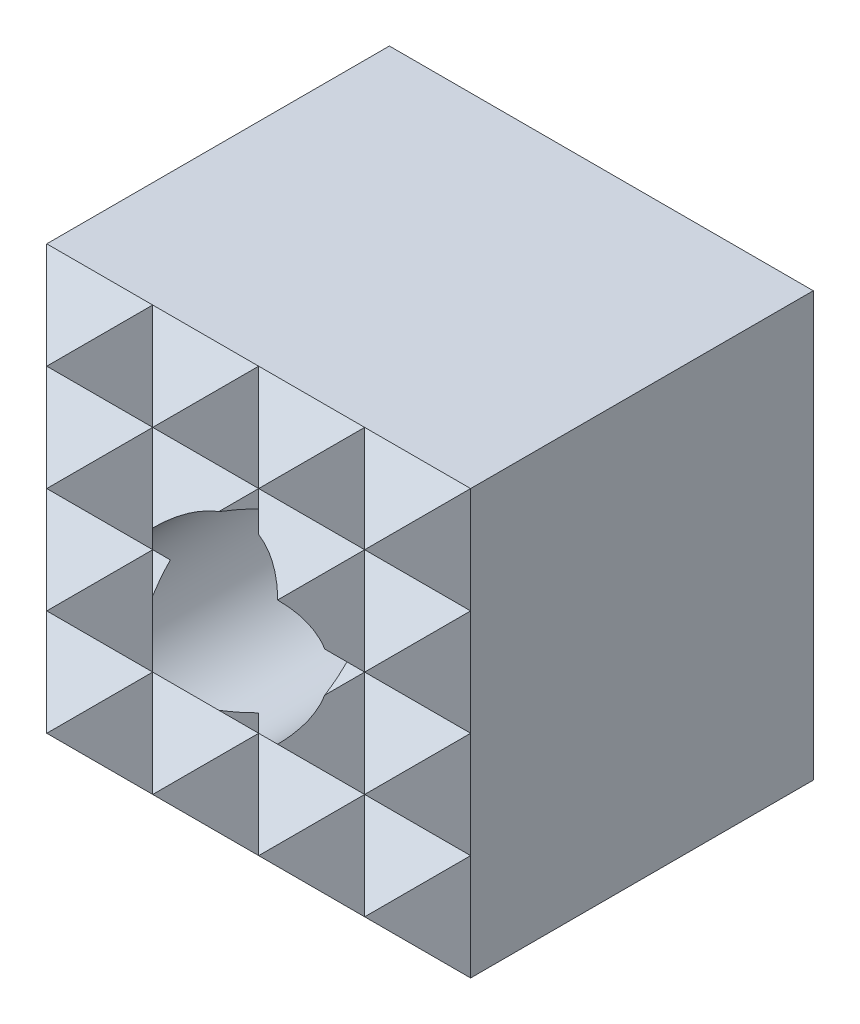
ISO-10303-21;
HEADER;
FILE_DESCRIPTION(('STEP AP214'),'2;1');
FILE_NAME('part.step','',(''),(''),'','','');
FILE_SCHEMA(('AUTOMOTIVE_DESIGN { 1 0 10303 214 1 1 1 1 }'));
ENDSEC;
DATA;
#1=APPLICATION_CONTEXT('core data for automotive mechanical design processes');
#2=APPLICATION_PROTOCOL_DEFINITION('international standard','automotive_design',2000,#1);
#3=PRODUCT_CONTEXT('',#1,'mechanical');
#4=PRODUCT('Part','Part','',(#3));
#5=PRODUCT_RELATED_PRODUCT_CATEGORY('part','',(#4));
#6=PRODUCT_DEFINITION_FORMATION('','',#4);
#7=PRODUCT_DEFINITION_CONTEXT('part definition',#1,'design');
#8=PRODUCT_DEFINITION('design','',#6,#7);
#9=PRODUCT_DEFINITION_SHAPE('','',#8);
#10=(LENGTH_UNIT() NAMED_UNIT(*) SI_UNIT(.MILLI.,.METRE.));
#11=(NAMED_UNIT(*) PLANE_ANGLE_UNIT() SI_UNIT($,.RADIAN.));
#12=(NAMED_UNIT(*) SI_UNIT($,.STERADIAN.) SOLID_ANGLE_UNIT());
#13=UNCERTAINTY_MEASURE_WITH_UNIT(LENGTH_MEASURE(1.E-05),#10,'distance_accuracy_value','');
#14=(GEOMETRIC_REPRESENTATION_CONTEXT(3) GLOBAL_UNCERTAINTY_ASSIGNED_CONTEXT((#13)) GLOBAL_UNIT_ASSIGNED_CONTEXT((#10,
#11,#12)) REPRESENTATION_CONTEXT('',''));
#15=CARTESIAN_POINT('',(0.,0.,0.));
#16=DIRECTION('',(0.,0.,1.));
#17=DIRECTION('',(1.,0.,0.));
#18=AXIS2_PLACEMENT_3D('',#15,#16,#17);
#19=CARTESIAN_POINT('',(-1.49999999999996,-10.,12.));
#20=DIRECTION('',(-0.707106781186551,0.,-0.707106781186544));
#21=DIRECTION('',(-0.707106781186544,0.,0.707106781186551));
#22=AXIS2_PLACEMENT_3D('',#19,#20,#21);
#23=PLANE('',#22);
#24=DIRECTION('',(0.,1.,0.));
#25=VECTOR('',#24,1.);
#26=CARTESIAN_POINT('',(0.,-10.,10.5));
#27=LINE('',#26,#25);
#28=CARTESIAN_POINT('',(0.,2.5,10.5));
#29=VERTEX_POINT('',#28);
#30=CARTESIAN_POINT('',(0.,3.,10.5));
#31=VERTEX_POINT('',#30);
#32=EDGE_CURVE('E484',#29,#31,#27,.T.);
#33=ORIENTED_EDGE('',*,*,#32,.T.);
#34=DIRECTION('',(-0.577350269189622,-0.577350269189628,0.577350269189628));
#35=VECTOR('',#34,1.);
#36=CARTESIAN_POINT('',(-5.33333333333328,-2.33333333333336,15.8333333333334));
#37=LINE('',#36,#35);
#38=CARTESIAN_POINT('',(-0.564585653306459,2.4354143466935,11.0645856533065));
#39=VERTEX_POINT('',#38);
#40=EDGE_CURVE('E468',#31,#39,#37,.T.);
#41=ORIENTED_EDGE('',*,*,#40,.T.);
#42=CARTESIAN_POINT('',(0.,0.,10.5));
#43=DIRECTION('',(-0.707106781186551,0.,-0.707106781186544));
#44=DIRECTION('',(-0.707106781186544,0.,0.707106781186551));
#45=AXIS2_PLACEMENT_3D('',#42,#43,#44);
#46=ELLIPSE('',#45,3.53553390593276,2.5);
#47=EDGE_CURVE('E331',#39,#29,#46,.T.);
#48=ORIENTED_EDGE('',*,*,#47,.T.);
#49=EDGE_LOOP('',(#33,#41,#48));
#50=FACE_BOUND('',#49,.T.);
#51=ADVANCED_FACE('F15',(#50),#23,.F.);
#52=CARTESIAN_POINT('',(0.,-10.,10.5));
#53=DIRECTION('',(0.707106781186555,0.,-0.707106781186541));
#54=DIRECTION('',(-0.707106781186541,0.,-0.707106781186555));
#55=AXIS2_PLACEMENT_3D('',#52,#53,#54);
#56=PLANE('',#55);
#57=CARTESIAN_POINT('',(0.,-3.,10.5));
#58=VERTEX_POINT('',#57);
#59=CARTESIAN_POINT('',(0.,-2.5,10.5));
#60=VERTEX_POINT('',#59);
#61=EDGE_CURVE('E486',#58,#60,#27,.T.);
#62=ORIENTED_EDGE('',*,*,#61,.F.);
#63=DIRECTION('',(0.577350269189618,0.577350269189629,0.57735026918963));
#64=VECTOR('',#63,1.);
#65=CARTESIAN_POINT('',(-2.33333333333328,-5.33333333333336,8.16666666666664));
#66=LINE('',#65,#64);
#67=CARTESIAN_POINT('',(0.564585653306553,-2.43541434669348,11.0645856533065));
#68=VERTEX_POINT('',#67);
#69=EDGE_CURVE('E419',#58,#68,#66,.T.);
#70=ORIENTED_EDGE('',*,*,#69,.T.);
#71=CARTESIAN_POINT('',(0.,0.,10.5));
#72=DIRECTION('',(0.707106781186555,0.,-0.707106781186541));
#73=DIRECTION('',(0.707106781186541,0.,0.707106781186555));
#74=AXIS2_PLACEMENT_3D('',#71,#72,#73);
#75=ELLIPSE('',#74,3.53553390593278,2.5);
#76=EDGE_CURVE('E327',#68,#60,#75,.T.);
#77=ORIENTED_EDGE('',*,*,#76,.T.);
#78=EDGE_LOOP('',(#62,#70,#77));
#79=FACE_BOUND('',#78,.T.);
#80=ADVANCED_FACE('F561',(#79),#56,.F.);
#81=CARTESIAN_POINT('',(-2.99999999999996,-10.,10.5));
#82=DIRECTION('',(0.707106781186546,0.,-0.707106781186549));
#83=DIRECTION('',(-0.707106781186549,0.,-0.707106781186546));
#84=AXIS2_PLACEMENT_3D('',#81,#82,#83);
#85=PLANE('',#84);
#86=DIRECTION('',(0.,1.,0.));
#87=VECTOR('',#86,1.);
#88=CARTESIAN_POINT('',(-2.99999999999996,-10.,10.5));
#89=LINE('',#88,#87);
#90=CARTESIAN_POINT('',(-2.99999999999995,0.,10.5));
#91=VERTEX_POINT('',#90);
#92=CARTESIAN_POINT('',(-2.99999999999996,3.,10.5));
#93=VERTEX_POINT('',#92);
#94=EDGE_CURVE('E688',#91,#93,#89,.T.);
#95=ORIENTED_EDGE('',*,*,#94,.F.);
#96=DIRECTION('',(0.577350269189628,0.577350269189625,0.577350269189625));
#97=VECTOR('',#96,1.);
#98=CARTESIAN_POINT('',(-6.3333333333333,-3.33333333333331,7.16666666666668));
#99=LINE('',#98,#97);
#100=CARTESIAN_POINT('',(-2.43541434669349,0.564585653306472,11.0645856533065));
#101=VERTEX_POINT('',#100);
#102=EDGE_CURVE('E450',#91,#101,#99,.T.);
#103=ORIENTED_EDGE('',*,*,#102,.T.);
#104=CARTESIAN_POINT('',(0.,0.,13.5));
#105=DIRECTION('',(0.707106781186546,0.,-0.707106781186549));
#106=DIRECTION('',(0.707106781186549,0.,0.707106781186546));
#107=AXIS2_PLACEMENT_3D('',#104,#105,#106);
#108=ELLIPSE('',#107,3.53553390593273,2.5);
#109=CARTESIAN_POINT('',(-1.76776695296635,1.76776695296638,11.7322330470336));
#110=VERTEX_POINT('',#109);
#111=EDGE_CURVE('E332',#101,#110,#108,.T.);
#112=ORIENTED_EDGE('',*,*,#111,.T.);
#113=DIRECTION('',(-0.577350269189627,0.577350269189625,-0.577350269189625));
#114=VECTOR('',#113,1.);
#115=CARTESIAN_POINT('',(1.33333333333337,-1.33333333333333,14.8333333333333));
#116=LINE('',#115,#114);
#117=EDGE_CURVE('E248',#110,#93,#116,.T.);
#118=ORIENTED_EDGE('',*,*,#117,.T.);
#119=EDGE_LOOP('',(#95,#103,#112,#118));
#120=FACE_BOUND('',#119,.T.);
#121=ADVANCED_FACE('F609',(#120),#85,.F.);
#122=CARTESIAN_POINT('',(-1.76776695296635,-1.76776695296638,11.7322330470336));
#123=VERTEX_POINT('',#122);
#124=CARTESIAN_POINT('',(-2.43541434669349,-0.564585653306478,11.0645856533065));
#125=VERTEX_POINT('',#124);
#126=EDGE_CURVE('E335',#123,#125,#108,.T.);
#127=ORIENTED_EDGE('',*,*,#126,.T.);
#128=DIRECTION('',(-0.577350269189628,0.577350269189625,-0.577350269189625));
#129=VECTOR('',#128,1.);
#130=CARTESIAN_POINT('',(0.333333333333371,-3.33333333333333,13.8333333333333));
#131=LINE('',#130,#129);
#132=EDGE_CURVE('E434',#125,#91,#131,.T.);
#133=ORIENTED_EDGE('',*,*,#132,.T.);
#134=CARTESIAN_POINT('',(-2.99999999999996,-3.,10.5));
#135=VERTEX_POINT('',#134);
#136=EDGE_CURVE('E271',#135,#91,#89,.T.);
#137=ORIENTED_EDGE('',*,*,#136,.F.);
#138=DIRECTION('',(0.577350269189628,0.577350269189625,0.577350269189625));
#139=VECTOR('',#138,1.);
#140=CARTESIAN_POINT('',(-5.3333333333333,-5.33333333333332,8.16666666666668));
#141=LINE('',#140,#139);
#142=EDGE_CURVE('E410',#135,#123,#141,.T.);
#143=ORIENTED_EDGE('',*,*,#142,.T.);
#144=EDGE_LOOP('',(#127,#133,#137,#143));
#145=FACE_BOUND('',#144,.T.);
#146=ADVANCED_FACE('F614',(#145),#85,.F.);
#147=CARTESIAN_POINT('',(-0.564585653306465,-2.43541434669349,11.0645856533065));
#148=VERTEX_POINT('',#147);
#149=EDGE_CURVE('E328',#60,#148,#46,.T.);
#150=ORIENTED_EDGE('',*,*,#149,.T.);
#151=DIRECTION('',(0.577350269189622,-0.577350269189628,-0.577350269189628));
#152=VECTOR('',#151,1.);
#153=CARTESIAN_POINT('',(1.33333333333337,-4.33333333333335,9.16666666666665));
#154=LINE('',#153,#152);
#155=EDGE_CURVE('E415',#148,#58,#154,.T.);
#156=ORIENTED_EDGE('',*,*,#155,.T.);
#157=ORIENTED_EDGE('',*,*,#61,.T.);
#158=EDGE_LOOP('',(#150,#156,#157));
#159=FACE_BOUND('',#158,.T.);
#160=ADVANCED_FACE('F564',(#159),#23,.F.);
#161=CARTESIAN_POINT('',(0.564585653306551,2.43541434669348,11.0645856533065));
#162=VERTEX_POINT('',#161);
#163=EDGE_CURVE('E324',#29,#162,#75,.T.);
#164=ORIENTED_EDGE('',*,*,#163,.T.);
#165=DIRECTION('',(-0.577350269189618,0.57735026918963,-0.57735026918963));
#166=VECTOR('',#165,1.);
#167=CARTESIAN_POINT('',(4.33333333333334,-1.33333333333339,14.8333333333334));
#168=LINE('',#167,#166);
#169=EDGE_CURVE('E472',#162,#31,#168,.T.);
#170=ORIENTED_EDGE('',*,*,#169,.T.);
#171=ORIENTED_EDGE('',*,*,#32,.F.);
#172=EDGE_LOOP('',(#164,#170,#171));
#173=FACE_BOUND('',#172,.T.);
#174=ADVANCED_FACE('F610',(#173),#56,.F.);
#175=CARTESIAN_POINT('',(1.5,-10.,12.));
#176=DIRECTION('',(-0.70710678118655,0.,-0.707106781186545));
#177=DIRECTION('',(-0.707106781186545,0.,0.70710678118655));
#178=AXIS2_PLACEMENT_3D('',#175,#176,#177);
#179=PLANE('',#178);
#180=CARTESIAN_POINT('',(0.,0.,13.5));
#181=DIRECTION('',(-0.70710678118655,0.,-0.707106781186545));
#182=DIRECTION('',(-0.707106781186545,0.,0.70710678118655));
#183=AXIS2_PLACEMENT_3D('',#180,#181,#182);
#184=ELLIPSE('',#183,3.53553390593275,2.5);
#185=CARTESIAN_POINT('',(1.76776695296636,1.76776695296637,11.7322330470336));
#186=VERTEX_POINT('',#185);
#187=CARTESIAN_POINT('',(2.43541434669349,0.564585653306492,11.0645856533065));
#188=VERTEX_POINT('',#187);
#189=EDGE_CURVE('E323',#186,#188,#184,.T.);
#190=ORIENTED_EDGE('',*,*,#189,.T.);
#191=DIRECTION('',(0.577350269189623,-0.577350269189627,-0.577350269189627));
#192=VECTOR('',#191,1.);
#193=CARTESIAN_POINT('',(5.33333333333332,-2.33333333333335,8.16666666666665));
#194=LINE('',#193,#192);
#195=CARTESIAN_POINT('',(3.,0.,10.5));
#196=VERTEX_POINT('',#195);
#197=EDGE_CURVE('E461',#188,#196,#194,.T.);
#198=ORIENTED_EDGE('',*,*,#197,.T.);
#199=DIRECTION('',(0.,1.,0.));
#200=VECTOR('',#199,1.);
#201=CARTESIAN_POINT('',(3.,-10.,10.5));
#202=LINE('',#201,#200);
#203=CARTESIAN_POINT('',(3.,3.,10.5));
#204=VERTEX_POINT('',#203);
#205=EDGE_CURVE('E496',#196,#204,#202,.T.);
#206=ORIENTED_EDGE('',*,*,#205,.T.);
#207=DIRECTION('',(-0.577350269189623,-0.577350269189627,0.577350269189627));
#208=VECTOR('',#207,1.);
#209=CARTESIAN_POINT('',(-2.33333333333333,-2.33333333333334,15.8333333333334));
#210=LINE('',#209,#208);
#211=EDGE_CURVE('E475',#204,#186,#210,.T.);
#212=ORIENTED_EDGE('',*,*,#211,.T.);
#213=EDGE_LOOP('',(#190,#198,#206,#212));
#214=FACE_BOUND('',#213,.T.);
#215=ADVANCED_FACE('F601',(#214),#179,.F.);
#216=CARTESIAN_POINT('',(3.,-3.,10.5));
#217=VERTEX_POINT('',#216);
#218=EDGE_CURVE('E490',#217,#196,#202,.T.);
#219=ORIENTED_EDGE('',*,*,#218,.T.);
#220=DIRECTION('',(-0.577350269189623,-0.577350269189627,0.577350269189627));
#221=VECTOR('',#220,1.);
#222=CARTESIAN_POINT('',(-1.33333333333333,-4.33333333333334,14.8333333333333));
#223=LINE('',#222,#221);
#224=CARTESIAN_POINT('',(2.43541434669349,-0.564585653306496,11.0645856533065));
#225=VERTEX_POINT('',#224);
#226=EDGE_CURVE('E446',#196,#225,#223,.T.);
#227=ORIENTED_EDGE('',*,*,#226,.T.);
#228=CARTESIAN_POINT('',(1.76776695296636,-1.76776695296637,11.7322330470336));
#229=VERTEX_POINT('',#228);
#230=EDGE_CURVE('E309',#225,#229,#184,.T.);
#231=ORIENTED_EDGE('',*,*,#230,.T.);
#232=DIRECTION('',(0.577350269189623,-0.577350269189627,-0.577350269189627));
#233=VECTOR('',#232,1.);
#234=CARTESIAN_POINT('',(4.33333333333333,-4.33333333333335,9.16666666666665));
#235=LINE('',#234,#233);
#236=EDGE_CURVE('E422',#229,#217,#235,.T.);
#237=ORIENTED_EDGE('',*,*,#236,.T.);
#238=EDGE_LOOP('',(#219,#227,#231,#237));
#239=FACE_BOUND('',#238,.T.);
#240=ADVANCED_FACE('F540',(#239),#179,.F.);
#241=CARTESIAN_POINT('',(3.,-10.,10.5));
#242=DIRECTION('',(0.707106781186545,0.,-0.70710678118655));
#243=DIRECTION('',(-0.70710678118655,0.,-0.707106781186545));
#244=AXIS2_PLACEMENT_3D('',#241,#242,#243);
#245=PLANE('',#244);
#246=ORIENTED_EDGE('',*,*,#218,.F.);
#247=DIRECTION('',(0.577350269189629,0.577350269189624,0.577350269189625));
#248=VECTOR('',#247,1.);
#249=CARTESIAN_POINT('',(0.666666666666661,-5.33333333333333,8.16666666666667));
#250=LINE('',#249,#248);
#251=CARTESIAN_POINT('',(4.5,-1.5,12.));
#252=VERTEX_POINT('',#251);
#253=EDGE_CURVE('E425',#217,#252,#250,.T.);
#254=ORIENTED_EDGE('',*,*,#253,.T.);
#255=DIRECTION('',(-0.577350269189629,0.577350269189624,-0.577350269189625));
#256=VECTOR('',#255,1.);
#257=CARTESIAN_POINT('',(6.33333333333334,-3.33333333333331,13.8333333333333));
#258=LINE('',#257,#256);
#259=EDGE_CURVE('E443',#252,#196,#258,.T.);
#260=ORIENTED_EDGE('',*,*,#259,.T.);
#261=EDGE_LOOP('',(#246,#254,#260));
#262=FACE_BOUND('',#261,.T.);
#263=ADVANCED_FACE('F538',(#262),#245,.F.);
#264=ORIENTED_EDGE('',*,*,#205,.F.);
#265=DIRECTION('',(0.577350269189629,0.577350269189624,0.577350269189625));
#266=VECTOR('',#265,1.);
#267=CARTESIAN_POINT('',(-0.333333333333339,-3.33333333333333,7.16666666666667));
#268=LINE('',#267,#266);
#269=CARTESIAN_POINT('',(4.5,1.5,12.));
#270=VERTEX_POINT('',#269);
#271=EDGE_CURVE('E458',#196,#270,#268,.T.);
#272=ORIENTED_EDGE('',*,*,#271,.T.);
#273=DIRECTION('',(-0.577350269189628,0.577350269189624,-0.577350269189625));
#274=VECTOR('',#273,1.);
#275=CARTESIAN_POINT('',(7.33333333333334,-1.3333333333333,14.8333333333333));
#276=LINE('',#275,#274);
#277=EDGE_CURVE('E478',#270,#204,#276,.T.);
#278=ORIENTED_EDGE('',*,*,#277,.T.);
#279=EDGE_LOOP('',(#264,#272,#278));
#280=FACE_BOUND('',#279,.T.);
#281=ADVANCED_FACE('F805',(#280),#245,.F.);
#282=CARTESIAN_POINT('',(4.5,-10.,12.));
#283=DIRECTION('',(-0.70710678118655,0.,-0.707106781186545));
#284=DIRECTION('',(-0.707106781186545,0.,0.70710678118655));
#285=AXIS2_PLACEMENT_3D('',#282,#283,#284);
#286=PLANE('',#285);
#287=DIRECTION('',(-0.577350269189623,-0.577350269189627,0.577350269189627));
#288=VECTOR('',#287,1.);
#289=CARTESIAN_POINT('',(2.66666666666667,-6.33333333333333,13.8333333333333));
#290=LINE('',#289,#288);
#291=CARTESIAN_POINT('',(6.,-3.,10.5));
#292=VERTEX_POINT('',#291);
#293=CARTESIAN_POINT('',(4.5,-4.5,12.));
#294=VERTEX_POINT('',#293);
#295=EDGE_CURVE('E405',#292,#294,#290,.T.);
#296=ORIENTED_EDGE('',*,*,#295,.T.);
#297=DIRECTION('',(0.577350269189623,-0.577350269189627,-0.577350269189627));
#298=VECTOR('',#297,1.);
#299=CARTESIAN_POINT('',(6.33333333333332,-6.33333333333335,10.1666666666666));
#300=LINE('',#299,#298);
#301=CARTESIAN_POINT('',(6.,-6.,10.5));
#302=VERTEX_POINT('',#301);
#303=EDGE_CURVE('E387',#294,#302,#300,.T.);
#304=ORIENTED_EDGE('',*,*,#303,.T.);
#305=DIRECTION('',(0.,1.,0.));
#306=VECTOR('',#305,1.);
#307=CARTESIAN_POINT('',(6.,-10.,10.5));
#308=LINE('',#307,#306);
#309=EDGE_CURVE('E268',#302,#292,#308,.T.);
#310=ORIENTED_EDGE('',*,*,#309,.T.);
#311=EDGE_LOOP('',(#296,#304,#310));
#312=FACE_BOUND('',#311,.T.);
#313=ADVANCED_FACE('F702',(#312),#286,.F.);
#314=DIRECTION('',(-0.577350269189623,-0.577350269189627,0.577350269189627));
#315=VECTOR('',#314,1.);
#316=CARTESIAN_POINT('',(1.66666666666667,-4.33333333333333,14.8333333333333));
#317=LINE('',#316,#315);
#318=CARTESIAN_POINT('',(6.,0.,10.5));
#319=VERTEX_POINT('',#318);
#320=EDGE_CURVE('E439',#319,#252,#317,.T.);
#321=ORIENTED_EDGE('',*,*,#320,.T.);
#322=DIRECTION('',(0.577350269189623,-0.577350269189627,-0.577350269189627));
#323=VECTOR('',#322,1.);
#324=CARTESIAN_POINT('',(7.33333333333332,-4.33333333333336,9.16666666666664));
#325=LINE('',#324,#323);
#326=EDGE_CURVE('E428',#252,#292,#325,.T.);
#327=ORIENTED_EDGE('',*,*,#326,.T.);
#328=EDGE_CURVE('E504',#292,#319,#308,.T.);
#329=ORIENTED_EDGE('',*,*,#328,.T.);
#330=EDGE_LOOP('',(#321,#327,#329));
#331=FACE_BOUND('',#330,.T.);
#332=ADVANCED_FACE('F522',(#331),#286,.F.);
#333=DIRECTION('',(-0.577350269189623,-0.577350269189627,0.577350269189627));
#334=VECTOR('',#333,1.);
#335=CARTESIAN_POINT('',(0.666666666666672,-2.33333333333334,15.8333333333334));
#336=LINE('',#335,#334);
#337=CARTESIAN_POINT('',(6.,3.,10.5));
#338=VERTEX_POINT('',#337);
#339=EDGE_CURVE('E481',#338,#270,#336,.T.);
#340=ORIENTED_EDGE('',*,*,#339,.T.);
#341=DIRECTION('',(0.577350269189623,-0.577350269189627,-0.577350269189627));
#342=VECTOR('',#341,1.);
#343=CARTESIAN_POINT('',(8.33333333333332,-2.33333333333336,8.16666666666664));
#344=LINE('',#343,#342);
#345=EDGE_CURVE('E455',#270,#319,#344,.T.);
#346=ORIENTED_EDGE('',*,*,#345,.T.);
#347=EDGE_CURVE('E508',#319,#338,#308,.T.);
#348=ORIENTED_EDGE('',*,*,#347,.T.);
#349=EDGE_LOOP('',(#340,#346,#348));
#350=FACE_BOUND('',#349,.T.);
#351=ADVANCED_FACE('F517',(#350),#286,.F.);
#352=CARTESIAN_POINT('',(-6.,-10.,10.5));
#353=DIRECTION('',(0.707106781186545,0.,-0.70710678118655));
#354=DIRECTION('',(-0.70710678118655,0.,-0.707106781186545));
#355=AXIS2_PLACEMENT_3D('',#352,#353,#354);
#356=PLANE('',#355);
#357=DIRECTION('',(0.,1.,0.));
#358=VECTOR('',#357,1.);
#359=CARTESIAN_POINT('',(-6.,-10.,10.5));
#360=LINE('',#359,#358);
#361=CARTESIAN_POINT('',(-6.,-6.,10.5));
#362=VERTEX_POINT('',#361);
#363=CARTESIAN_POINT('',(-6.,-3.,10.5));
#364=VERTEX_POINT('',#363);
#365=EDGE_CURVE('E259',#362,#364,#360,.T.);
#366=ORIENTED_EDGE('',*,*,#365,.F.);
#367=DIRECTION('',(0.577350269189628,0.577350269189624,0.577350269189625));
#368=VECTOR('',#367,1.);
#369=CARTESIAN_POINT('',(-7.33333333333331,-7.33333333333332,9.16666666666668));
#370=LINE('',#369,#368);
#371=CARTESIAN_POINT('',(-4.49999999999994,-4.5,12.));
#372=VERTEX_POINT('',#371);
#373=EDGE_CURVE('E362',#362,#372,#370,.T.);
#374=ORIENTED_EDGE('',*,*,#373,.T.);
#375=DIRECTION('',(-0.577350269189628,0.577350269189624,-0.577350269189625));
#376=VECTOR('',#375,1.);
#377=CARTESIAN_POINT('',(-3.66666666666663,-5.33333333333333,12.8333333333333));
#378=LINE('',#377,#376);
#379=EDGE_CURVE('E364',#372,#364,#378,.T.);
#380=ORIENTED_EDGE('',*,*,#379,.T.);
#381=EDGE_LOOP('',(#366,#374,#380));
#382=FACE_BOUND('',#381,.T.);
#383=ADVANCED_FACE('F363',(#382),#356,.F.);
#384=CARTESIAN_POINT('',(-6.,0.,10.5));
#385=VERTEX_POINT('',#384);
#386=EDGE_CURVE('E264',#364,#385,#360,.T.);
#387=ORIENTED_EDGE('',*,*,#386,.F.);
#388=DIRECTION('',(0.577350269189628,0.577350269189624,0.577350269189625));
#389=VECTOR('',#388,1.);
#390=CARTESIAN_POINT('',(-8.33333333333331,-5.33333333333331,8.16666666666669));
#391=LINE('',#390,#389);
#392=CARTESIAN_POINT('',(-4.49999999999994,-1.5,12.));
#393=VERTEX_POINT('',#392);
#394=EDGE_CURVE('E407',#364,#393,#391,.T.);
#395=ORIENTED_EDGE('',*,*,#394,.T.);
#396=DIRECTION('',(-0.577350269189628,0.577350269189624,-0.577350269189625));
#397=VECTOR('',#396,1.);
#398=CARTESIAN_POINT('',(-2.66666666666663,-3.33333333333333,13.8333333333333));
#399=LINE('',#398,#397);
#400=EDGE_CURVE('E431',#393,#385,#399,.T.);
#401=ORIENTED_EDGE('',*,*,#400,.T.);
#402=EDGE_LOOP('',(#387,#395,#401));
#403=FACE_BOUND('',#402,.T.);
#404=ADVANCED_FACE('F824',(#403),#356,.F.);
#405=CARTESIAN_POINT('',(-6.,3.,10.5));
#406=VERTEX_POINT('',#405);
#407=EDGE_CURVE('E245',#385,#406,#360,.T.);
#408=ORIENTED_EDGE('',*,*,#407,.F.);
#409=DIRECTION('',(0.577350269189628,0.577350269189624,0.577350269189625));
#410=VECTOR('',#409,1.);
#411=CARTESIAN_POINT('',(-9.33333333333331,-3.33333333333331,7.16666666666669));
#412=LINE('',#411,#410);
#413=CARTESIAN_POINT('',(-4.49999999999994,1.5,12.));
#414=VERTEX_POINT('',#413);
#415=EDGE_CURVE('E247',#385,#414,#412,.T.);
#416=ORIENTED_EDGE('',*,*,#415,.T.);
#417=DIRECTION('',(-0.577350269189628,0.577350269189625,-0.577350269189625));
#418=VECTOR('',#417,1.);
#419=CARTESIAN_POINT('',(-1.66666666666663,-1.33333333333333,14.8333333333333));
#420=LINE('',#419,#418);
#421=EDGE_CURVE('E232',#414,#406,#420,.T.);
#422=ORIENTED_EDGE('',*,*,#421,.T.);
#423=EDGE_LOOP('',(#408,#416,#422));
#424=FACE_BOUND('',#423,.T.);
#425=ADVANCED_FACE('F243',(#424),#356,.F.);
#426=CARTESIAN_POINT('',(-4.49999999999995,-10.,12.));
#427=DIRECTION('',(-0.70710678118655,0.,-0.707106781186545));
#428=DIRECTION('',(-0.707106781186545,0.,0.70710678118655));
#429=AXIS2_PLACEMENT_3D('',#426,#427,#428);
#430=PLANE('',#429);
#431=DIRECTION('',(-0.577350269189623,-0.577350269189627,0.577350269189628));
#432=VECTOR('',#431,1.);
#433=CARTESIAN_POINT('',(-7.33333333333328,-4.33333333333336,14.8333333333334));
#434=LINE('',#433,#432);
#435=EDGE_CURVE('E343',#91,#393,#434,.T.);
#436=ORIENTED_EDGE('',*,*,#435,.T.);
#437=DIRECTION('',(0.577350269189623,-0.577350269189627,-0.577350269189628));
#438=VECTOR('',#437,1.);
#439=CARTESIAN_POINT('',(-1.66666666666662,-4.33333333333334,9.16666666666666));
#440=LINE('',#439,#438);
#441=EDGE_CURVE('E346',#393,#135,#440,.T.);
#442=ORIENTED_EDGE('',*,*,#441,.T.);
#443=ORIENTED_EDGE('',*,*,#136,.T.);
#444=EDGE_LOOP('',(#436,#442,#443));
#445=FACE_BOUND('',#444,.T.);
#446=ADVANCED_FACE('F776',(#445),#430,.F.);
#447=DIRECTION('',(-0.577350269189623,-0.577350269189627,0.577350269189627));
#448=VECTOR('',#447,1.);
#449=CARTESIAN_POINT('',(-8.33333333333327,-2.33333333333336,15.8333333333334));
#450=LINE('',#449,#448);
#451=EDGE_CURVE('E235',#93,#414,#450,.T.);
#452=ORIENTED_EDGE('',*,*,#451,.T.);
#453=DIRECTION('',(0.577350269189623,-0.577350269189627,-0.577350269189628));
#454=VECTOR('',#453,1.);
#455=CARTESIAN_POINT('',(-0.666666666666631,-2.33333333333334,8.16666666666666));
#456=LINE('',#455,#454);
#457=EDGE_CURVE('E340',#414,#91,#456,.T.);
#458=ORIENTED_EDGE('',*,*,#457,.T.);
#459=ORIENTED_EDGE('',*,*,#94,.T.);
#460=EDGE_LOOP('',(#452,#458,#459));
#461=FACE_BOUND('',#460,.T.);
#462=ADVANCED_FACE('F1143',(#461),#430,.F.);
#463=CARTESIAN_POINT('',(-6.,-6.,0.));
#464=DIRECTION('',(0.,0.,-1.));
#465=DIRECTION('',(-1.,0.,0.));
#466=AXIS2_PLACEMENT_3D('',#463,#464,#465);
#467=PLANE('',#466);
#468=DIRECTION('',(0.,-1.,0.));
#469=VECTOR('',#468,1.);
#470=CARTESIAN_POINT('',(5.2,-6.,0.));
#471=LINE('',#470,#469);
#472=CARTESIAN_POINT('',(5.2,5.2,0.));
#473=VERTEX_POINT('',#472);
#474=CARTESIAN_POINT('',(5.2,-5.2,0.));
#475=VERTEX_POINT('',#474);
#476=EDGE_CURVE('E288',#473,#475,#471,.T.);
#477=ORIENTED_EDGE('',*,*,#476,.T.);
#478=DIRECTION('',(-1.,0.,0.));
#479=VECTOR('',#478,1.);
#480=CARTESIAN_POINT('',(-6.,-5.2,0.));
#481=LINE('',#480,#479);
#482=CARTESIAN_POINT('',(-5.2,-5.2,0.));
#483=VERTEX_POINT('',#482);
#484=EDGE_CURVE('E294',#475,#483,#481,.T.);
#485=ORIENTED_EDGE('',*,*,#484,.T.);
#486=DIRECTION('',(0.,1.,0.));
#487=VECTOR('',#486,1.);
#488=CARTESIAN_POINT('',(-5.2,6.,0.));
#489=LINE('',#488,#487);
#490=CARTESIAN_POINT('',(-5.2,5.2,0.));
#491=VERTEX_POINT('',#490);
#492=EDGE_CURVE('E292',#483,#491,#489,.T.);
#493=ORIENTED_EDGE('',*,*,#492,.T.);
#494=DIRECTION('',(1.,0.,0.));
#495=VECTOR('',#494,1.);
#496=CARTESIAN_POINT('',(-6.,5.2,0.));
#497=LINE('',#496,#495);
#498=EDGE_CURVE('E290',#491,#473,#497,.T.);
#499=ORIENTED_EDGE('',*,*,#498,.T.);
#500=EDGE_LOOP('',(#477,#485,#493,#499));
#501=FACE_BOUND('',#500,.T.);
#502=CARTESIAN_POINT('',(0.,0.,0.));
#503=DIRECTION('',(0.,0.,-1.));
#504=DIRECTION('',(-1.,0.,0.));
#505=AXIS2_PLACEMENT_3D('',#502,#503,#504);
#506=CIRCLE('',#505,2.95);
#507=CARTESIAN_POINT('',(-2.95,0.,0.));
#508=VERTEX_POINT('',#507);
#509=EDGE_CURVE('E282',#508,#508,#506,.F.);
#510=ORIENTED_EDGE('',*,*,#509,.T.);
#511=EDGE_LOOP('',(#510));
#512=FACE_BOUND('',#511,.T.);
#513=ADVANCED_FACE('F839',(#501,#512),#467,.T.);
#514=CARTESIAN_POINT('',(-6.,6.,12.));
#515=DIRECTION('',(1.,0.,0.));
#516=DIRECTION('',(0.,1.,0.));
#517=AXIS2_PLACEMENT_3D('',#514,#515,#516);
#518=PLANE('',#517);
#519=DIRECTION('',(0.,0.,-1.));
#520=VECTOR('',#519,1.);
#521=CARTESIAN_POINT('',(-6.,-6.,12.));
#522=LINE('',#521,#520);
#523=CARTESIAN_POINT('',(-6.,-6.,0.8));
#524=VERTEX_POINT('',#523);
#525=EDGE_CURVE('E280',#362,#524,#522,.T.);
#526=ORIENTED_EDGE('',*,*,#525,.F.);
#527=ORIENTED_EDGE('',*,*,#365,.T.);
#528=ORIENTED_EDGE('',*,*,#386,.T.);
#529=ORIENTED_EDGE('',*,*,#407,.T.);
#530=CARTESIAN_POINT('',(-6.,6.,10.5));
#531=VERTEX_POINT('',#530);
#532=EDGE_CURVE('E252',#406,#531,#360,.T.);
#533=ORIENTED_EDGE('',*,*,#532,.T.);
#534=DIRECTION('',(0.,0.,-1.));
#535=VECTOR('',#534,1.);
#536=CARTESIAN_POINT('',(-6.,6.,12.));
#537=LINE('',#536,#535);
#538=CARTESIAN_POINT('',(-6.,6.,0.8));
#539=VERTEX_POINT('',#538);
#540=EDGE_CURVE('E273',#531,#539,#537,.T.);
#541=ORIENTED_EDGE('',*,*,#540,.T.);
#542=DIRECTION('',(0.,-1.,0.));
#543=VECTOR('',#542,1.);
#544=CARTESIAN_POINT('',(-6.,-6.,0.8));
#545=LINE('',#544,#543);
#546=EDGE_CURVE('E300',#539,#524,#545,.T.);
#547=ORIENTED_EDGE('',*,*,#546,.T.);
#548=EDGE_LOOP('',(#526,#527,#528,#529,#533,#541,#547));
#549=FACE_BOUND('',#548,.T.);
#550=ADVANCED_FACE('F261',(#549),#518,.F.);
#551=CARTESIAN_POINT('',(6.,-6.,12.));
#552=DIRECTION('',(0.,-1.,0.));
#553=DIRECTION('',(1.,0.,0.));
#554=AXIS2_PLACEMENT_3D('',#551,#552,#553);
#555=PLANE('',#554);
#556=DIRECTION('',(1.,0.,0.));
#557=VECTOR('',#556,1.);
#558=CARTESIAN_POINT('',(-10.,-6.,10.5));
#559=LINE('',#558,#557);
#560=CARTESIAN_POINT('',(-2.99999999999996,-6.,10.5));
#561=VERTEX_POINT('',#560);
#562=EDGE_CURVE('E690',#362,#561,#559,.T.);
#563=ORIENTED_EDGE('',*,*,#562,.F.);
#564=ORIENTED_EDGE('',*,*,#525,.T.);
#565=DIRECTION('',(1.,0.,0.));
#566=VECTOR('',#565,1.);
#567=CARTESIAN_POINT('',(6.,-6.,0.8));
#568=LINE('',#567,#566);
#569=CARTESIAN_POINT('',(6.,-6.,0.8));
#570=VERTEX_POINT('',#569);
#571=EDGE_CURVE('E297',#524,#570,#568,.T.);
#572=ORIENTED_EDGE('',*,*,#571,.T.);
#573=DIRECTION('',(0.,0.,-1.));
#574=VECTOR('',#573,1.);
#575=CARTESIAN_POINT('',(6.,-6.,12.));
#576=LINE('',#575,#574);
#577=EDGE_CURVE('E278',#302,#570,#576,.T.);
#578=ORIENTED_EDGE('',*,*,#577,.F.);
#579=CARTESIAN_POINT('',(3.,-6.,10.5));
#580=VERTEX_POINT('',#579);
#581=EDGE_CURVE('E664',#580,#302,#559,.T.);
#582=ORIENTED_EDGE('',*,*,#581,.F.);
#583=CARTESIAN_POINT('',(0.,-6.,10.5));
#584=VERTEX_POINT('',#583);
#585=EDGE_CURVE('E578',#584,#580,#559,.T.);
#586=ORIENTED_EDGE('',*,*,#585,.F.);
#587=EDGE_CURVE('E693',#561,#584,#559,.T.);
#588=ORIENTED_EDGE('',*,*,#587,.F.);
#589=EDGE_LOOP('',(#563,#564,#572,#578,#582,#586,#588));
#590=FACE_BOUND('',#589,.T.);
#591=ADVANCED_FACE('F697',(#590),#555,.T.);
#592=CARTESIAN_POINT('',(6.,-6.,12.));
#593=DIRECTION('',(-1.,0.,0.));
#594=DIRECTION('',(0.,0.,1.));
#595=AXIS2_PLACEMENT_3D('',#592,#593,#594);
#596=PLANE('',#595);
#597=DIRECTION('',(0.,0.,-1.));
#598=VECTOR('',#597,1.);
#599=CARTESIAN_POINT('',(6.,6.,12.));
#600=LINE('',#599,#598);
#601=CARTESIAN_POINT('',(6.,6.,10.5));
#602=VERTEX_POINT('',#601);
#603=CARTESIAN_POINT('',(6.,6.,0.8));
#604=VERTEX_POINT('',#603);
#605=EDGE_CURVE('E275',#602,#604,#600,.T.);
#606=ORIENTED_EDGE('',*,*,#605,.F.);
#607=EDGE_CURVE('E267',#338,#602,#308,.T.);
#608=ORIENTED_EDGE('',*,*,#607,.F.);
#609=ORIENTED_EDGE('',*,*,#347,.F.);
#610=ORIENTED_EDGE('',*,*,#328,.F.);
#611=ORIENTED_EDGE('',*,*,#309,.F.);
#612=ORIENTED_EDGE('',*,*,#577,.T.);
#613=DIRECTION('',(0.,1.,0.));
#614=VECTOR('',#613,1.);
#615=CARTESIAN_POINT('',(6.,6.,0.8));
#616=LINE('',#615,#614);
#617=EDGE_CURVE('E306',#570,#604,#616,.T.);
#618=ORIENTED_EDGE('',*,*,#617,.T.);
#619=EDGE_LOOP('',(#606,#608,#609,#610,#611,#612,#618));
#620=FACE_BOUND('',#619,.T.);
#621=ADVANCED_FACE('F520',(#620),#596,.F.);
#622=CARTESIAN_POINT('',(-6.,6.,12.));
#623=DIRECTION('',(0.,1.,0.));
#624=DIRECTION('',(-1.,0.,0.));
#625=AXIS2_PLACEMENT_3D('',#622,#623,#624);
#626=PLANE('',#625);
#627=DIRECTION('',(1.,0.,0.));
#628=VECTOR('',#627,1.);
#629=CARTESIAN_POINT('',(-10.,6.,10.5));
#630=LINE('',#629,#628);
#631=CARTESIAN_POINT('',(3.,6.,10.5));
#632=VERTEX_POINT('',#631);
#633=EDGE_CURVE('E236',#632,#602,#630,.T.);
#634=ORIENTED_EDGE('',*,*,#633,.T.);
#635=ORIENTED_EDGE('',*,*,#605,.T.);
#636=DIRECTION('',(-1.,0.,0.));
#637=VECTOR('',#636,1.);
#638=CARTESIAN_POINT('',(-6.,6.,0.8));
#639=LINE('',#638,#637);
#640=EDGE_CURVE('E303',#604,#539,#639,.T.);
#641=ORIENTED_EDGE('',*,*,#640,.T.);
#642=ORIENTED_EDGE('',*,*,#540,.F.);
#643=CARTESIAN_POINT('',(-2.99999999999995,6.,10.5));
#644=VERTEX_POINT('',#643);
#645=EDGE_CURVE('E658',#531,#644,#630,.T.);
#646=ORIENTED_EDGE('',*,*,#645,.T.);
#647=CARTESIAN_POINT('',(0.,6.,10.5));
#648=VERTEX_POINT('',#647);
#649=EDGE_CURVE('E662',#644,#648,#630,.T.);
#650=ORIENTED_EDGE('',*,*,#649,.T.);
#651=EDGE_CURVE('E656',#648,#632,#630,.T.);
#652=ORIENTED_EDGE('',*,*,#651,.T.);
#653=EDGE_LOOP('',(#634,#635,#641,#642,#646,#650,#652));
#654=FACE_BOUND('',#653,.T.);
#655=ADVANCED_FACE('F660',(#654),#626,.T.);
#656=CARTESIAN_POINT('',(0.,0.,12.));
#657=DIRECTION('',(0.,0.,1.));
#658=DIRECTION('',(1.,0.,0.));
#659=AXIS2_PLACEMENT_3D('',#656,#657,#658);
#660=CYLINDRICAL_SURFACE('',#659,2.5);
#661=CARTESIAN_POINT('',(0.,0.,13.5));
#662=DIRECTION('',(0.,-0.707106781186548,-0.707106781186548));
#663=DIRECTION('',(0.,-0.707106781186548,0.707106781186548));
#664=AXIS2_PLACEMENT_3D('',#661,#662,#663);
#665=ELLIPSE('',#664,3.53553390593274,2.5);
#666=EDGE_CURVE('E466',#110,#39,#665,.T.);
#667=ORIENTED_EDGE('',*,*,#666,.F.);
#668=ORIENTED_EDGE('',*,*,#111,.F.);
#669=CARTESIAN_POINT('',(0.,0.,10.5));
#670=DIRECTION('',(0.,0.707106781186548,-0.707106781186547));
#671=DIRECTION('',(0.,0.707106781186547,0.707106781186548));
#672=AXIS2_PLACEMENT_3D('',#669,#670,#671);
#673=ELLIPSE('',#672,3.53553390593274,2.5);
#674=CARTESIAN_POINT('',(-2.5,0.,10.5));
#675=VERTEX_POINT('',#674);
#676=EDGE_CURVE('E453',#675,#101,#673,.T.);
#677=ORIENTED_EDGE('',*,*,#676,.F.);
#678=CARTESIAN_POINT('',(0.,0.,10.5));
#679=DIRECTION('',(0.,-0.707106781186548,-0.707106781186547));
#680=DIRECTION('',(0.,-0.707106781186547,0.707106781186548));
#681=AXIS2_PLACEMENT_3D('',#678,#679,#680);
#682=ELLIPSE('',#681,3.53553390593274,2.5);
#683=EDGE_CURVE('E437',#125,#675,#682,.T.);
#684=ORIENTED_EDGE('',*,*,#683,.F.);
#685=ORIENTED_EDGE('',*,*,#126,.F.);
#686=CARTESIAN_POINT('',(0.,0.,13.5));
#687=DIRECTION('',(0.,0.707106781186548,-0.707106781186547));
#688=DIRECTION('',(0.,0.707106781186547,0.707106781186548));
#689=AXIS2_PLACEMENT_3D('',#686,#687,#688);
#690=ELLIPSE('',#689,3.53553390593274,2.5);
#691=EDGE_CURVE('E413',#148,#123,#690,.T.);
#692=ORIENTED_EDGE('',*,*,#691,.F.);
#693=ORIENTED_EDGE('',*,*,#149,.F.);
#694=ORIENTED_EDGE('',*,*,#76,.F.);
#695=EDGE_CURVE('E416',#229,#68,#690,.T.);
#696=ORIENTED_EDGE('',*,*,#695,.F.);
#697=ORIENTED_EDGE('',*,*,#230,.F.);
#698=CARTESIAN_POINT('',(2.5,0.,10.5));
#699=VERTEX_POINT('',#698);
#700=EDGE_CURVE('E440',#699,#225,#682,.T.);
#701=ORIENTED_EDGE('',*,*,#700,.F.);
#702=EDGE_CURVE('E249',#188,#699,#673,.T.);
#703=ORIENTED_EDGE('',*,*,#702,.F.);
#704=ORIENTED_EDGE('',*,*,#189,.F.);
#705=EDGE_CURVE('E469',#162,#186,#665,.T.);
#706=ORIENTED_EDGE('',*,*,#705,.F.);
#707=ORIENTED_EDGE('',*,*,#163,.F.);
#708=ORIENTED_EDGE('',*,*,#47,.F.);
#709=EDGE_LOOP('',(#667,#668,#677,#684,#685,#692,#693,#694,#696,#697,#701,#703,#704,#706,#707,#708));
#710=FACE_BOUND('',#709,.T.);
#711=CARTESIAN_POINT('',(0.,0.,0.45));
#712=DIRECTION('',(0.,0.,-1.));
#713=DIRECTION('',(-1.,0.,0.));
#714=AXIS2_PLACEMENT_3D('',#711,#712,#713);
#715=CIRCLE('',#714,2.5);
#716=CARTESIAN_POINT('',(-2.5,0.,0.45));
#717=VERTEX_POINT('',#716);
#718=EDGE_CURVE('E285',#717,#717,#715,.T.);
#719=ORIENTED_EDGE('',*,*,#718,.T.);
#720=EDGE_LOOP('',(#719));
#721=FACE_BOUND('',#720,.T.);
#722=ADVANCED_FACE('F553',(#710,#721),#660,.F.);
#723=CARTESIAN_POINT('',(0.,0.,0.));
#724=DIRECTION('',(0.,0.,-1.));
#725=DIRECTION('',(-1.,0.,0.));
#726=AXIS2_PLACEMENT_3D('',#723,#724,#725);
#727=CONICAL_SURFACE('',#726,2.95,0.785398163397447);
#728=ORIENTED_EDGE('',*,*,#718,.F.);
#729=EDGE_LOOP('',(#728));
#730=FACE_BOUND('',#729,.T.);
#731=ORIENTED_EDGE('',*,*,#509,.F.);
#732=EDGE_LOOP('',(#731));
#733=FACE_BOUND('',#732,.T.);
#734=ADVANCED_FACE('F848',(#730,#733),#727,.F.);
#735=CARTESIAN_POINT('',(-6.,5.2,0.));
#736=DIRECTION('',(0.,-0.707106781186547,0.707106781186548));
#737=DIRECTION('',(0.,-0.707106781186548,-0.707106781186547));
#738=AXIS2_PLACEMENT_3D('',#735,#736,#737);
#739=PLANE('',#738);
#740=DIRECTION('',(0.577350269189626,-0.577350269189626,-0.577350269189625));
#741=VECTOR('',#740,1.);
#742=CARTESIAN_POINT('',(-5.46666666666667,5.46666666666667,0.266666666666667));
#743=LINE('',#742,#741);
#744=EDGE_CURVE('E316',#539,#491,#743,.T.);
#745=ORIENTED_EDGE('',*,*,#744,.F.);
#746=ORIENTED_EDGE('',*,*,#640,.F.);
#747=DIRECTION('',(-0.577350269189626,-0.577350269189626,-0.577350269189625));
#748=VECTOR('',#747,1.);
#749=CARTESIAN_POINT('',(2.,2.,-3.2));
#750=LINE('',#749,#748);
#751=EDGE_CURVE('E276',#473,#604,#750,.F.);
#752=ORIENTED_EDGE('',*,*,#751,.F.);
#753=ORIENTED_EDGE('',*,*,#498,.F.);
#754=EDGE_LOOP('',(#745,#746,#752,#753));
#755=FACE_BOUND('',#754,.T.);
#756=ADVANCED_FACE('F17',(#755),#739,.F.);
#757=CARTESIAN_POINT('',(6.,-6.,0.8));
#758=DIRECTION('',(0.707106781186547,0.,-0.707106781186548));
#759=DIRECTION('',(-0.707106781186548,0.,-0.707106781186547));
#760=AXIS2_PLACEMENT_3D('',#757,#758,#759);
#761=PLANE('',#760);
#762=ORIENTED_EDGE('',*,*,#751,.T.);
#763=ORIENTED_EDGE('',*,*,#617,.F.);
#764=DIRECTION('',(0.577350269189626,-0.577350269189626,0.577350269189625));
#765=VECTOR('',#764,1.);
#766=CARTESIAN_POINT('',(6.,-6.,0.8));
#767=LINE('',#766,#765);
#768=EDGE_CURVE('E312',#475,#570,#767,.T.);
#769=ORIENTED_EDGE('',*,*,#768,.F.);
#770=ORIENTED_EDGE('',*,*,#476,.F.);
#771=EDGE_LOOP('',(#762,#763,#769,#770));
#772=FACE_BOUND('',#771,.T.);
#773=ADVANCED_FACE('F844',(#772),#761,.T.);
#774=CARTESIAN_POINT('',(-6.,6.,0.8));
#775=DIRECTION('',(-0.707106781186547,0.,-0.707106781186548));
#776=DIRECTION('',(-0.707106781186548,0.,0.707106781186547));
#777=AXIS2_PLACEMENT_3D('',#774,#775,#776);
#778=PLANE('',#777);
#779=ORIENTED_EDGE('',*,*,#744,.T.);
#780=ORIENTED_EDGE('',*,*,#492,.F.);
#781=DIRECTION('',(0.577350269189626,0.577350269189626,-0.577350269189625));
#782=VECTOR('',#781,1.);
#783=CARTESIAN_POINT('',(-2.,-2.,-3.2));
#784=LINE('',#783,#782);
#785=EDGE_CURVE('E310',#524,#483,#784,.T.);
#786=ORIENTED_EDGE('',*,*,#785,.F.);
#787=ORIENTED_EDGE('',*,*,#546,.F.);
#788=EDGE_LOOP('',(#779,#780,#786,#787));
#789=FACE_BOUND('',#788,.T.);
#790=ADVANCED_FACE('F835',(#789),#778,.T.);
#791=CARTESIAN_POINT('',(-6.,-5.2,0.));
#792=DIRECTION('',(0.,0.707106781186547,0.707106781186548));
#793=DIRECTION('',(0.,-0.707106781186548,0.707106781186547));
#794=AXIS2_PLACEMENT_3D('',#791,#792,#793);
#795=PLANE('',#794);
#796=ORIENTED_EDGE('',*,*,#768,.T.);
#797=ORIENTED_EDGE('',*,*,#571,.F.);
#798=ORIENTED_EDGE('',*,*,#785,.T.);
#799=ORIENTED_EDGE('',*,*,#484,.F.);
#800=EDGE_LOOP('',(#796,#797,#798,#799));
#801=FACE_BOUND('',#800,.T.);
#802=ADVANCED_FACE('F829',(#801),#795,.F.);
#803=ORIENTED_EDGE('',*,*,#607,.T.);
#804=DIRECTION('',(-0.577350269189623,-0.577350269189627,0.577350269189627));
#805=VECTOR('',#804,1.);
#806=CARTESIAN_POINT('',(-0.333333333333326,-0.333333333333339,16.8333333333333));
#807=LINE('',#806,#805);
#808=CARTESIAN_POINT('',(4.5,4.5,12.));
#809=VERTEX_POINT('',#808);
#810=EDGE_CURVE('E369',#602,#809,#807,.T.);
#811=ORIENTED_EDGE('',*,*,#810,.T.);
#812=DIRECTION('',(0.577350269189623,-0.577350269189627,-0.577350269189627));
#813=VECTOR('',#812,1.);
#814=CARTESIAN_POINT('',(9.33333333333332,-0.333333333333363,7.16666666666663));
#815=LINE('',#814,#813);
#816=EDGE_CURVE('E676',#809,#338,#815,.T.);
#817=ORIENTED_EDGE('',*,*,#816,.T.);
#818=EDGE_LOOP('',(#803,#811,#817));
#819=FACE_BOUND('',#818,.T.);
#820=ADVANCED_FACE('F865',(#819),#286,.F.);
#821=DIRECTION('',(0.577350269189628,0.577350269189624,0.577350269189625));
#822=VECTOR('',#821,1.);
#823=CARTESIAN_POINT('',(-10.3333333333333,-1.3333333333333,6.1666666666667));
#824=LINE('',#823,#822);
#825=CARTESIAN_POINT('',(-4.49999999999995,4.5,12.));
#826=VERTEX_POINT('',#825);
#827=EDGE_CURVE('E215',#406,#826,#824,.T.);
#828=ORIENTED_EDGE('',*,*,#827,.T.);
#829=DIRECTION('',(-0.577350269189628,0.577350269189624,-0.577350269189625));
#830=VECTOR('',#829,1.);
#831=CARTESIAN_POINT('',(-0.666666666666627,0.666666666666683,15.8333333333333));
#832=LINE('',#831,#830);
#833=EDGE_CURVE('E254',#826,#531,#832,.T.);
#834=ORIENTED_EDGE('',*,*,#833,.T.);
#835=ORIENTED_EDGE('',*,*,#532,.F.);
#836=EDGE_LOOP('',(#828,#834,#835));
#837=FACE_BOUND('',#836,.T.);
#838=ADVANCED_FACE('F253',(#837),#356,.F.);
#839=CARTESIAN_POINT('',(-10.,4.5,12.));
#840=DIRECTION('',(0.,0.707106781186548,-0.707106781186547));
#841=DIRECTION('',(0.,0.707106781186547,0.707106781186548));
#842=AXIS2_PLACEMENT_3D('',#839,#840,#841);
#843=PLANE('',#842);
#844=DIRECTION('',(1.,0.,0.));
#845=VECTOR('',#844,1.);
#846=CARTESIAN_POINT('',(-10.,3.,10.5));
#847=LINE('',#846,#845);
#848=EDGE_CURVE('E218',#406,#93,#847,.T.);
#849=ORIENTED_EDGE('',*,*,#848,.T.);
#850=DIRECTION('',(0.577350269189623,-0.577350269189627,-0.577350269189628));
#851=VECTOR('',#850,1.);
#852=CARTESIAN_POINT('',(0.333333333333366,-0.333333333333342,7.16666666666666));
#853=LINE('',#852,#851);
#854=EDGE_CURVE('E221',#826,#93,#853,.T.);
#855=ORIENTED_EDGE('',*,*,#854,.F.);
#856=ORIENTED_EDGE('',*,*,#827,.F.);
#857=EDGE_LOOP('',(#849,#855,#856));
#858=FACE_BOUND('',#857,.T.);
#859=ADVANCED_FACE('F217',(#858),#843,.F.);
#860=CARTESIAN_POINT('',(-10.,3.,10.5));
#861=DIRECTION('',(0.,-0.707106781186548,-0.707106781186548));
#862=DIRECTION('',(0.,0.707106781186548,-0.707106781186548));
#863=AXIS2_PLACEMENT_3D('',#860,#861,#862);
#864=PLANE('',#863);
#865=ORIENTED_EDGE('',*,*,#451,.F.);
#866=ORIENTED_EDGE('',*,*,#848,.F.);
#867=ORIENTED_EDGE('',*,*,#421,.F.);
#868=EDGE_LOOP('',(#865,#866,#867));
#869=FACE_BOUND('',#868,.T.);
#870=ADVANCED_FACE('F231',(#869),#864,.F.);
#871=CARTESIAN_POINT('',(-10.,6.,10.5));
#872=DIRECTION('',(0.,-0.707106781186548,-0.707106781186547));
#873=DIRECTION('',(0.,0.707106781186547,-0.707106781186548));
#874=AXIS2_PLACEMENT_3D('',#871,#872,#873);
#875=PLANE('',#874);
#876=DIRECTION('',(-0.577350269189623,-0.577350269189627,0.577350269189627));
#877=VECTOR('',#876,1.);
#878=CARTESIAN_POINT('',(-9.33333333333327,-0.333333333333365,16.8333333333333));
#879=LINE('',#878,#877);
#880=EDGE_CURVE('E337',#644,#826,#879,.T.);
#881=ORIENTED_EDGE('',*,*,#880,.F.);
#882=ORIENTED_EDGE('',*,*,#645,.F.);
#883=ORIENTED_EDGE('',*,*,#833,.F.);
#884=EDGE_LOOP('',(#881,#882,#883));
#885=FACE_BOUND('',#884,.T.);
#886=ADVANCED_FACE('F716',(#885),#875,.F.);
#887=CARTESIAN_POINT('',(-10.,-4.5,12.));
#888=DIRECTION('',(0.,0.707106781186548,-0.707106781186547));
#889=DIRECTION('',(0.,0.707106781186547,0.707106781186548));
#890=AXIS2_PLACEMENT_3D('',#887,#888,#889);
#891=PLANE('',#890);
#892=ORIENTED_EDGE('',*,*,#562,.T.);
#893=DIRECTION('',(0.577350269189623,-0.577350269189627,-0.577350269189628));
#894=VECTOR('',#893,1.);
#895=CARTESIAN_POINT('',(-2.66666666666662,-6.33333333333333,10.1666666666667));
#896=LINE('',#895,#894);
#897=EDGE_CURVE('E9',#372,#561,#896,.T.);
#898=ORIENTED_EDGE('',*,*,#897,.F.);
#899=ORIENTED_EDGE('',*,*,#373,.F.);
#900=EDGE_LOOP('',(#892,#898,#899));
#901=FACE_BOUND('',#900,.T.);
#902=ADVANCED_FACE('F706',(#901),#891,.F.);
#903=CARTESIAN_POINT('',(-10.,-3.,10.5));
#904=DIRECTION('',(0.,-0.707106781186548,-0.707106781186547));
#905=DIRECTION('',(0.,0.707106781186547,-0.707106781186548));
#906=AXIS2_PLACEMENT_3D('',#903,#904,#905);
#907=PLANE('',#906);
#908=DIRECTION('',(-0.577350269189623,-0.577350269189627,0.577350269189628));
#909=VECTOR('',#908,1.);
#910=CARTESIAN_POINT('',(-6.33333333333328,-6.33333333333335,13.8333333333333));
#911=LINE('',#910,#909);
#912=EDGE_CURVE('E23',#135,#372,#911,.T.);
#913=ORIENTED_EDGE('',*,*,#912,.F.);
#914=DIRECTION('',(1.,0.,0.));
#915=VECTOR('',#914,1.);
#916=CARTESIAN_POINT('',(-10.,-3.,10.5));
#917=LINE('',#916,#915);
#918=EDGE_CURVE('E694',#364,#135,#917,.T.);
#919=ORIENTED_EDGE('',*,*,#918,.F.);
#920=ORIENTED_EDGE('',*,*,#379,.F.);
#921=EDGE_LOOP('',(#913,#919,#920));
#922=FACE_BOUND('',#921,.T.);
#923=ADVANCED_FACE('F712',(#922),#907,.F.);
#924=CARTESIAN_POINT('',(-10.,-1.5,12.));
#925=DIRECTION('',(0.,0.707106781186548,-0.707106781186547));
#926=DIRECTION('',(0.,0.707106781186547,0.707106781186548));
#927=AXIS2_PLACEMENT_3D('',#924,#925,#926);
#928=PLANE('',#927);
#929=ORIENTED_EDGE('',*,*,#918,.T.);
#930=ORIENTED_EDGE('',*,*,#441,.F.);
#931=ORIENTED_EDGE('',*,*,#394,.F.);
#932=EDGE_LOOP('',(#929,#930,#931));
#933=FACE_BOUND('',#932,.T.);
#934=ADVANCED_FACE('F723',(#933),#928,.F.);
#935=CARTESIAN_POINT('',(-10.,0.,10.5));
#936=DIRECTION('',(0.,-0.707106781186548,-0.707106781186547));
#937=DIRECTION('',(0.,0.707106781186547,-0.707106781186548));
#938=AXIS2_PLACEMENT_3D('',#935,#936,#937);
#939=PLANE('',#938);
#940=ORIENTED_EDGE('',*,*,#435,.F.);
#941=DIRECTION('',(1.,0.,0.));
#942=VECTOR('',#941,1.);
#943=CARTESIAN_POINT('',(-10.,0.,10.5));
#944=LINE('',#943,#942);
#945=EDGE_CURVE('E227',#385,#91,#944,.T.);
#946=ORIENTED_EDGE('',*,*,#945,.F.);
#947=ORIENTED_EDGE('',*,*,#400,.F.);
#948=EDGE_LOOP('',(#940,#946,#947));
#949=FACE_BOUND('',#948,.T.);
#950=ADVANCED_FACE('F748',(#949),#939,.F.);
#951=CARTESIAN_POINT('',(-10.,1.5,12.));
#952=DIRECTION('',(0.,0.707106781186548,-0.707106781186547));
#953=DIRECTION('',(0.,0.707106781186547,0.707106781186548));
#954=AXIS2_PLACEMENT_3D('',#951,#952,#953);
#955=PLANE('',#954);
#956=ORIENTED_EDGE('',*,*,#945,.T.);
#957=ORIENTED_EDGE('',*,*,#457,.F.);
#958=ORIENTED_EDGE('',*,*,#415,.F.);
#959=EDGE_LOOP('',(#956,#957,#958));
#960=FACE_BOUND('',#959,.T.);
#961=ADVANCED_FACE('F760',(#960),#955,.F.);
#962=DIRECTION('',(0.577350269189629,0.577350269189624,0.577350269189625));
#963=VECTOR('',#962,1.);
#964=CARTESIAN_POINT('',(-1.33333333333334,-1.33333333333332,6.16666666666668));
#965=LINE('',#964,#963);
#966=EDGE_CURVE('E649',#204,#809,#965,.T.);
#967=ORIENTED_EDGE('',*,*,#966,.F.);
#968=EDGE_CURVE('E239',#204,#338,#847,.T.);
#969=ORIENTED_EDGE('',*,*,#968,.T.);
#970=ORIENTED_EDGE('',*,*,#816,.F.);
#971=EDGE_LOOP('',(#967,#969,#970));
#972=FACE_BOUND('',#971,.T.);
#973=ADVANCED_FACE('F595',(#972),#843,.F.);
#974=ORIENTED_EDGE('',*,*,#968,.F.);
#975=ORIENTED_EDGE('',*,*,#277,.F.);
#976=ORIENTED_EDGE('',*,*,#339,.F.);
#977=EDGE_LOOP('',(#974,#975,#976));
#978=FACE_BOUND('',#977,.T.);
#979=ADVANCED_FACE('F713',(#978),#864,.F.);
#980=ORIENTED_EDGE('',*,*,#633,.F.);
#981=DIRECTION('',(-0.577350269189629,0.577350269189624,-0.577350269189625));
#982=VECTOR('',#981,1.);
#983=CARTESIAN_POINT('',(8.33333333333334,0.666666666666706,15.8333333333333));
#984=LINE('',#983,#982);
#985=EDGE_CURVE('E373',#809,#632,#984,.T.);
#986=ORIENTED_EDGE('',*,*,#985,.F.);
#987=ORIENTED_EDGE('',*,*,#810,.F.);
#988=EDGE_LOOP('',(#980,#986,#987));
#989=FACE_BOUND('',#988,.T.);
#990=ADVANCED_FACE('F652',(#989),#875,.F.);
#991=DIRECTION('',(0.577350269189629,0.577350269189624,0.577350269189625));
#992=VECTOR('',#991,1.);
#993=CARTESIAN_POINT('',(1.66666666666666,-7.33333333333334,9.16666666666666));
#994=LINE('',#993,#992);
#995=EDGE_CURVE('E384',#580,#294,#994,.T.);
#996=ORIENTED_EDGE('',*,*,#995,.F.);
#997=ORIENTED_EDGE('',*,*,#581,.T.);
#998=ORIENTED_EDGE('',*,*,#303,.F.);
#999=EDGE_LOOP('',(#996,#997,#998));
#1000=FACE_BOUND('',#999,.T.);
#1001=ADVANCED_FACE('F703',(#1000),#891,.F.);
#1002=EDGE_CURVE('E529',#217,#292,#917,.T.);
#1003=ORIENTED_EDGE('',*,*,#1002,.F.);
#1004=DIRECTION('',(-0.577350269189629,0.577350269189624,-0.577350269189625));
#1005=VECTOR('',#1004,1.);
#1006=CARTESIAN_POINT('',(5.33333333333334,-5.33333333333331,12.8333333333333));
#1007=LINE('',#1006,#1005);
#1008=EDGE_CURVE('E402',#294,#217,#1007,.T.);
#1009=ORIENTED_EDGE('',*,*,#1008,.F.);
#1010=ORIENTED_EDGE('',*,*,#295,.F.);
#1011=EDGE_LOOP('',(#1003,#1009,#1010));
#1012=FACE_BOUND('',#1011,.T.);
#1013=ADVANCED_FACE('F701',(#1012),#907,.F.);
#1014=ORIENTED_EDGE('',*,*,#253,.F.);
#1015=ORIENTED_EDGE('',*,*,#1002,.T.);
#1016=ORIENTED_EDGE('',*,*,#326,.F.);
#1017=EDGE_LOOP('',(#1014,#1015,#1016));
#1018=FACE_BOUND('',#1017,.T.);
#1019=ADVANCED_FACE('F527',(#1018),#928,.F.);
#1020=ORIENTED_EDGE('',*,*,#320,.F.);
#1021=EDGE_CURVE('E534',#196,#319,#944,.T.);
#1022=ORIENTED_EDGE('',*,*,#1021,.F.);
#1023=ORIENTED_EDGE('',*,*,#259,.F.);
#1024=EDGE_LOOP('',(#1020,#1022,#1023));
#1025=FACE_BOUND('',#1024,.T.);
#1026=ADVANCED_FACE('F532',(#1025),#939,.F.);
#1027=ORIENTED_EDGE('',*,*,#1021,.T.);
#1028=ORIENTED_EDGE('',*,*,#345,.F.);
#1029=ORIENTED_EDGE('',*,*,#271,.F.);
#1030=EDGE_LOOP('',(#1027,#1028,#1029));
#1031=FACE_BOUND('',#1030,.T.);
#1032=ADVANCED_FACE('F753',(#1031),#955,.F.);
#1033=ORIENTED_EDGE('',*,*,#966,.T.);
#1034=ORIENTED_EDGE('',*,*,#985,.T.);
#1035=EDGE_CURVE('E491',#204,#632,#202,.T.);
#1036=ORIENTED_EDGE('',*,*,#1035,.F.);
#1037=EDGE_LOOP('',(#1033,#1034,#1036));
#1038=FACE_BOUND('',#1037,.T.);
#1039=ADVANCED_FACE('F598',(#1038),#245,.F.);
#1040=ORIENTED_EDGE('',*,*,#1035,.T.);
#1041=DIRECTION('',(-0.577350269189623,-0.577350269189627,0.577350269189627));
#1042=VECTOR('',#1041,1.);
#1043=CARTESIAN_POINT('',(-3.33333333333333,-0.333333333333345,16.8333333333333));
#1044=LINE('',#1043,#1042);
#1045=CARTESIAN_POINT('',(1.5,4.5,12.));
#1046=VERTEX_POINT('',#1045);
#1047=EDGE_CURVE('E639',#632,#1046,#1044,.T.);
#1048=ORIENTED_EDGE('',*,*,#1047,.T.);
#1049=DIRECTION('',(0.577350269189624,-0.577350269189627,-0.577350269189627));
#1050=VECTOR('',#1049,1.);
#1051=CARTESIAN_POINT('',(6.33333333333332,-0.333333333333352,7.16666666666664));
#1052=LINE('',#1051,#1050);
#1053=EDGE_CURVE('E673',#1046,#204,#1052,.T.);
#1054=ORIENTED_EDGE('',*,*,#1053,.T.);
#1055=EDGE_LOOP('',(#1040,#1048,#1054));
#1056=FACE_BOUND('',#1055,.T.);
#1057=ADVANCED_FACE('F585',(#1056),#179,.F.);
#1058=EDGE_CURVE('E488',#580,#217,#202,.T.);
#1059=ORIENTED_EDGE('',*,*,#1058,.F.);
#1060=ORIENTED_EDGE('',*,*,#995,.T.);
#1061=ORIENTED_EDGE('',*,*,#1008,.T.);
#1062=EDGE_LOOP('',(#1059,#1060,#1061));
#1063=FACE_BOUND('',#1062,.T.);
#1064=ADVANCED_FACE('F583',(#1063),#245,.F.);
#1065=ORIENTED_EDGE('',*,*,#1058,.T.);
#1066=DIRECTION('',(-0.577350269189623,-0.577350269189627,0.577350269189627));
#1067=VECTOR('',#1066,1.);
#1068=CARTESIAN_POINT('',(-0.333333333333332,-6.33333333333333,13.8333333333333));
#1069=LINE('',#1068,#1067);
#1070=CARTESIAN_POINT('',(1.5,-4.5,12.));
#1071=VERTEX_POINT('',#1070);
#1072=EDGE_CURVE('E399',#217,#1071,#1069,.T.);
#1073=ORIENTED_EDGE('',*,*,#1072,.T.);
#1074=DIRECTION('',(0.577350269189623,-0.577350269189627,-0.577350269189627));
#1075=VECTOR('',#1074,1.);
#1076=CARTESIAN_POINT('',(3.33333333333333,-6.33333333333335,10.1666666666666));
#1077=LINE('',#1076,#1075);
#1078=EDGE_CURVE('E381',#1071,#580,#1077,.T.);
#1079=ORIENTED_EDGE('',*,*,#1078,.T.);
#1080=EDGE_LOOP('',(#1065,#1073,#1079));
#1081=FACE_BOUND('',#1080,.T.);
#1082=ADVANCED_FACE('F580',(#1081),#179,.F.);
#1083=DIRECTION('',(0.577350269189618,0.577350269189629,0.57735026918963));
#1084=VECTOR('',#1083,1.);
#1085=CARTESIAN_POINT('',(-4.33333333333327,-1.33333333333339,6.16666666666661));
#1086=LINE('',#1085,#1084);
#1087=EDGE_CURVE('E636',#31,#1046,#1086,.T.);
#1088=ORIENTED_EDGE('',*,*,#1087,.F.);
#1089=EDGE_CURVE('E667',#31,#204,#847,.T.);
#1090=ORIENTED_EDGE('',*,*,#1089,.T.);
#1091=ORIENTED_EDGE('',*,*,#1053,.F.);
#1092=EDGE_LOOP('',(#1088,#1090,#1091));
#1093=FACE_BOUND('',#1092,.T.);
#1094=ADVANCED_FACE('F582',(#1093),#843,.F.);
#1095=ORIENTED_EDGE('',*,*,#1089,.F.);
#1096=ORIENTED_EDGE('',*,*,#169,.F.);
#1097=ORIENTED_EDGE('',*,*,#705,.T.);
#1098=ORIENTED_EDGE('',*,*,#211,.F.);
#1099=EDGE_LOOP('',(#1095,#1096,#1097,#1098));
#1100=FACE_BOUND('',#1099,.T.);
#1101=ADVANCED_FACE('F591',(#1100),#864,.F.);
#1102=ORIENTED_EDGE('',*,*,#651,.F.);
#1103=DIRECTION('',(-0.577350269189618,0.577350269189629,-0.57735026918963));
#1104=VECTOR('',#1103,1.);
#1105=CARTESIAN_POINT('',(5.33333333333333,0.666666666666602,15.8333333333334));
#1106=LINE('',#1105,#1104);
#1107=EDGE_CURVE('E634',#1046,#648,#1106,.T.);
#1108=ORIENTED_EDGE('',*,*,#1107,.F.);
#1109=ORIENTED_EDGE('',*,*,#1047,.F.);
#1110=EDGE_LOOP('',(#1102,#1108,#1109));
#1111=FACE_BOUND('',#1110,.T.);
#1112=ADVANCED_FACE('F715',(#1111),#875,.F.);
#1113=DIRECTION('',(0.577350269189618,0.577350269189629,0.57735026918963));
#1114=VECTOR('',#1113,1.);
#1115=CARTESIAN_POINT('',(-1.33333333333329,-7.33333333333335,9.16666666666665));
#1116=LINE('',#1115,#1114);
#1117=EDGE_CURVE('E378',#584,#1071,#1116,.T.);
#1118=ORIENTED_EDGE('',*,*,#1117,.F.);
#1119=ORIENTED_EDGE('',*,*,#585,.T.);
#1120=ORIENTED_EDGE('',*,*,#1078,.F.);
#1121=EDGE_LOOP('',(#1118,#1119,#1120));
#1122=FACE_BOUND('',#1121,.T.);
#1123=ADVANCED_FACE('F577',(#1122),#891,.F.);
#1124=EDGE_CURVE('E548',#58,#217,#917,.T.);
#1125=ORIENTED_EDGE('',*,*,#1124,.F.);
#1126=DIRECTION('',(-0.577350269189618,0.577350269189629,-0.57735026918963));
#1127=VECTOR('',#1126,1.);
#1128=CARTESIAN_POINT('',(2.33333333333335,-5.33333333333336,12.8333333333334));
#1129=LINE('',#1128,#1127);
#1130=EDGE_CURVE('E396',#1071,#58,#1129,.T.);
#1131=ORIENTED_EDGE('',*,*,#1130,.F.);
#1132=ORIENTED_EDGE('',*,*,#1072,.F.);
#1133=EDGE_LOOP('',(#1125,#1131,#1132));
#1134=FACE_BOUND('',#1133,.T.);
#1135=ADVANCED_FACE('F574',(#1134),#907,.F.);
#1136=ORIENTED_EDGE('',*,*,#695,.T.);
#1137=ORIENTED_EDGE('',*,*,#69,.F.);
#1138=ORIENTED_EDGE('',*,*,#1124,.T.);
#1139=ORIENTED_EDGE('',*,*,#236,.F.);
#1140=EDGE_LOOP('',(#1136,#1137,#1138,#1139));
#1141=FACE_BOUND('',#1140,.T.);
#1142=ADVANCED_FACE('F545',(#1141),#928,.F.);
#1143=ORIENTED_EDGE('',*,*,#700,.T.);
#1144=ORIENTED_EDGE('',*,*,#226,.F.);
#1145=EDGE_CURVE('E765',#699,#196,#944,.T.);
#1146=ORIENTED_EDGE('',*,*,#1145,.F.);
#1147=EDGE_LOOP('',(#1143,#1144,#1146));
#1148=FACE_BOUND('',#1147,.T.);
#1149=ADVANCED_FACE('F742',(#1148),#939,.F.);
#1150=ORIENTED_EDGE('',*,*,#702,.T.);
#1151=ORIENTED_EDGE('',*,*,#1145,.T.);
#1152=ORIENTED_EDGE('',*,*,#197,.F.);
#1153=EDGE_LOOP('',(#1150,#1151,#1152));
#1154=FACE_BOUND('',#1153,.T.);
#1155=ADVANCED_FACE('F626',(#1154),#955,.F.);
#1156=ORIENTED_EDGE('',*,*,#1087,.T.);
#1157=ORIENTED_EDGE('',*,*,#1107,.T.);
#1158=EDGE_CURVE('E487',#31,#648,#27,.T.);
#1159=ORIENTED_EDGE('',*,*,#1158,.F.);
#1160=EDGE_LOOP('',(#1156,#1157,#1159));
#1161=FACE_BOUND('',#1160,.T.);
#1162=ADVANCED_FACE('F611',(#1161),#56,.F.);
#1163=ORIENTED_EDGE('',*,*,#1158,.T.);
#1164=DIRECTION('',(-0.577350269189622,-0.577350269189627,0.577350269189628));
#1165=VECTOR('',#1164,1.);
#1166=CARTESIAN_POINT('',(-6.33333333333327,-0.333333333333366,16.8333333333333));
#1167=LINE('',#1166,#1165);
#1168=CARTESIAN_POINT('',(-1.49999999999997,4.5,12.));
#1169=VERTEX_POINT('',#1168);
#1170=EDGE_CURVE('E631',#648,#1169,#1167,.T.);
#1171=ORIENTED_EDGE('',*,*,#1170,.T.);
#1172=DIRECTION('',(0.577350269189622,-0.577350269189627,-0.577350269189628));
#1173=VECTOR('',#1172,1.);
#1174=CARTESIAN_POINT('',(3.33333333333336,-0.333333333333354,7.16666666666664));
#1175=LINE('',#1174,#1173);
#1176=EDGE_CURVE('E30',#1169,#31,#1175,.T.);
#1177=ORIENTED_EDGE('',*,*,#1176,.T.);
#1178=EDGE_LOOP('',(#1163,#1171,#1177));
#1179=FACE_BOUND('',#1178,.T.);
#1180=ADVANCED_FACE('F615',(#1179),#23,.F.);
#1181=EDGE_CURVE('E313',#584,#58,#27,.T.);
#1182=ORIENTED_EDGE('',*,*,#1181,.T.);
#1183=DIRECTION('',(-0.577350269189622,-0.577350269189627,0.577350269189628));
#1184=VECTOR('',#1183,1.);
#1185=CARTESIAN_POINT('',(-3.33333333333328,-6.33333333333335,13.8333333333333));
#1186=LINE('',#1185,#1184);
#1187=CARTESIAN_POINT('',(-1.49999999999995,-4.5,12.));
#1188=VERTEX_POINT('',#1187);
#1189=EDGE_CURVE('E393',#58,#1188,#1186,.T.);
#1190=ORIENTED_EDGE('',*,*,#1189,.T.);
#1191=DIRECTION('',(0.577350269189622,-0.577350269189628,-0.577350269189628));
#1192=VECTOR('',#1191,1.);
#1193=CARTESIAN_POINT('',(0.333333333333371,-6.33333333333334,10.1666666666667));
#1194=LINE('',#1193,#1192);
#1195=EDGE_CURVE('E38',#1188,#584,#1194,.T.);
#1196=ORIENTED_EDGE('',*,*,#1195,.T.);
#1197=EDGE_LOOP('',(#1182,#1190,#1196));
#1198=FACE_BOUND('',#1197,.T.);
#1199=ADVANCED_FACE('F567',(#1198),#23,.F.);
#1200=ORIENTED_EDGE('',*,*,#1117,.T.);
#1201=ORIENTED_EDGE('',*,*,#1130,.T.);
#1202=ORIENTED_EDGE('',*,*,#1181,.F.);
#1203=EDGE_LOOP('',(#1200,#1201,#1202));
#1204=FACE_BOUND('',#1203,.T.);
#1205=ADVANCED_FACE('F570',(#1204),#56,.F.);
#1206=DIRECTION('',(0.577350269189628,0.577350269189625,0.577350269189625));
#1207=VECTOR('',#1206,1.);
#1208=CARTESIAN_POINT('',(-4.3333333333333,-7.33333333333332,9.16666666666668));
#1209=LINE('',#1208,#1207);
#1210=EDGE_CURVE('E368',#561,#1188,#1209,.T.);
#1211=ORIENTED_EDGE('',*,*,#1210,.F.);
#1212=ORIENTED_EDGE('',*,*,#587,.T.);
#1213=ORIENTED_EDGE('',*,*,#1195,.F.);
#1214=EDGE_LOOP('',(#1211,#1212,#1213));
#1215=FACE_BOUND('',#1214,.T.);
#1216=ADVANCED_FACE('F621',(#1215),#891,.F.);
#1217=EDGE_CURVE('E764',#135,#58,#917,.T.);
#1218=ORIENTED_EDGE('',*,*,#1217,.F.);
#1219=DIRECTION('',(-0.577350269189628,0.577350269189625,-0.577350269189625));
#1220=VECTOR('',#1219,1.);
#1221=CARTESIAN_POINT('',(-0.666666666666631,-5.33333333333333,12.8333333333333));
#1222=LINE('',#1221,#1220);
#1223=EDGE_CURVE('E391',#1188,#135,#1222,.T.);
#1224=ORIENTED_EDGE('',*,*,#1223,.F.);
#1225=ORIENTED_EDGE('',*,*,#1189,.F.);
#1226=EDGE_LOOP('',(#1218,#1224,#1225));
#1227=FACE_BOUND('',#1226,.T.);
#1228=ADVANCED_FACE('F724',(#1227),#907,.F.);
#1229=ORIENTED_EDGE('',*,*,#691,.T.);
#1230=ORIENTED_EDGE('',*,*,#142,.F.);
#1231=ORIENTED_EDGE('',*,*,#1217,.T.);
#1232=ORIENTED_EDGE('',*,*,#155,.F.);
#1233=EDGE_LOOP('',(#1229,#1230,#1231,#1232));
#1234=FACE_BOUND('',#1233,.T.);
#1235=ADVANCED_FACE('F730',(#1234),#928,.F.);
#1236=DIRECTION('',(0.577350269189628,0.577350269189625,0.577350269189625));
#1237=VECTOR('',#1236,1.);
#1238=CARTESIAN_POINT('',(-7.3333333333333,-1.33333333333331,6.16666666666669));
#1239=LINE('',#1238,#1237);
#1240=EDGE_CURVE('E226',#93,#1169,#1239,.T.);
#1241=ORIENTED_EDGE('',*,*,#1240,.F.);
#1242=EDGE_CURVE('E237',#93,#31,#847,.T.);
#1243=ORIENTED_EDGE('',*,*,#1242,.T.);
#1244=ORIENTED_EDGE('',*,*,#1176,.F.);
#1245=EDGE_LOOP('',(#1241,#1243,#1244));
#1246=FACE_BOUND('',#1245,.T.);
#1247=ADVANCED_FACE('F594',(#1246),#843,.F.);
#1248=ORIENTED_EDGE('',*,*,#1242,.F.);
#1249=ORIENTED_EDGE('',*,*,#117,.F.);
#1250=ORIENTED_EDGE('',*,*,#666,.T.);
#1251=ORIENTED_EDGE('',*,*,#40,.F.);
#1252=EDGE_LOOP('',(#1248,#1249,#1250,#1251));
#1253=FACE_BOUND('',#1252,.T.);
#1254=ADVANCED_FACE('F904',(#1253),#864,.F.);
#1255=ORIENTED_EDGE('',*,*,#649,.F.);
#1256=DIRECTION('',(-0.577350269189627,0.577350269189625,-0.577350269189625));
#1257=VECTOR('',#1256,1.);
#1258=CARTESIAN_POINT('',(2.33333333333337,0.666666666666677,15.8333333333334));
#1259=LINE('',#1258,#1257);
#1260=EDGE_CURVE('E642',#1169,#644,#1259,.T.);
#1261=ORIENTED_EDGE('',*,*,#1260,.F.);
#1262=ORIENTED_EDGE('',*,*,#1170,.F.);
#1263=EDGE_LOOP('',(#1255,#1261,#1262));
#1264=FACE_BOUND('',#1263,.T.);
#1265=ADVANCED_FACE('F725',(#1264),#875,.F.);
#1266=ORIENTED_EDGE('',*,*,#676,.T.);
#1267=ORIENTED_EDGE('',*,*,#102,.F.);
#1268=EDGE_CURVE('E792',#91,#675,#944,.T.);
#1269=ORIENTED_EDGE('',*,*,#1268,.T.);
#1270=EDGE_LOOP('',(#1266,#1267,#1269));
#1271=FACE_BOUND('',#1270,.T.);
#1272=ADVANCED_FACE('F795',(#1271),#955,.F.);
#1273=ORIENTED_EDGE('',*,*,#683,.T.);
#1274=ORIENTED_EDGE('',*,*,#1268,.F.);
#1275=ORIENTED_EDGE('',*,*,#132,.F.);
#1276=EDGE_LOOP('',(#1273,#1274,#1275));
#1277=FACE_BOUND('',#1276,.T.);
#1278=ADVANCED_FACE('F754',(#1277),#939,.F.);
#1279=EDGE_CURVE('E272',#93,#644,#89,.T.);
#1280=ORIENTED_EDGE('',*,*,#1279,.T.);
#1281=ORIENTED_EDGE('',*,*,#880,.T.);
#1282=ORIENTED_EDGE('',*,*,#854,.T.);
#1283=EDGE_LOOP('',(#1280,#1281,#1282));
#1284=FACE_BOUND('',#1283,.T.);
#1285=ADVANCED_FACE('F686',(#1284),#430,.F.);
#1286=ORIENTED_EDGE('',*,*,#1240,.T.);
#1287=ORIENTED_EDGE('',*,*,#1260,.T.);
#1288=ORIENTED_EDGE('',*,*,#1279,.F.);
#1289=EDGE_LOOP('',(#1286,#1287,#1288));
#1290=FACE_BOUND('',#1289,.T.);
#1291=ADVANCED_FACE('F682',(#1290),#85,.F.);
#1292=ORIENTED_EDGE('',*,*,#912,.T.);
#1293=ORIENTED_EDGE('',*,*,#897,.T.);
#1294=EDGE_CURVE('E257',#561,#135,#89,.T.);
#1295=ORIENTED_EDGE('',*,*,#1294,.T.);
#1296=EDGE_LOOP('',(#1292,#1293,#1295));
#1297=FACE_BOUND('',#1296,.T.);
#1298=ADVANCED_FACE('F352',(#1297),#430,.F.);
#1299=ORIENTED_EDGE('',*,*,#1210,.T.);
#1300=ORIENTED_EDGE('',*,*,#1223,.T.);
#1301=ORIENTED_EDGE('',*,*,#1294,.F.);
#1302=EDGE_LOOP('',(#1299,#1300,#1301));
#1303=FACE_BOUND('',#1302,.T.);
#1304=ADVANCED_FACE('F769',(#1303),#85,.F.);
#1305=CLOSED_SHELL('',(#51,#80,#121,#146,#160,#174,#215,#240,#263,#281,#313,#332,#351,#383,#404,
#425,#446,#462,#513,#550,#591,#621,#655,#722,#734,#756,#773,#790,#802,#820,#838,#859,#870,#886,
#902,#923,#934,#950,#961,#973,#979,#990,#1001,#1013,#1019,#1026,#1032,#1039,#1057,#1064,#1082,
#1094,#1101,#1112,#1123,#1135,#1142,#1149,#1155,#1162,#1180,#1199,#1205,#1216,#1228,#1235,#1247,
#1254,#1265,#1272,#1278,#1285,#1291,#1298,#1304));
#1306=MANIFOLD_SOLID_BREP('B1',#1305);
#1307=ADVANCED_BREP_SHAPE_REPRESENTATION('',(#18,#1306),#14);
#1308=SHAPE_DEFINITION_REPRESENTATION(#9,#1307);
ENDSEC;
END-ISO-10303-21;
